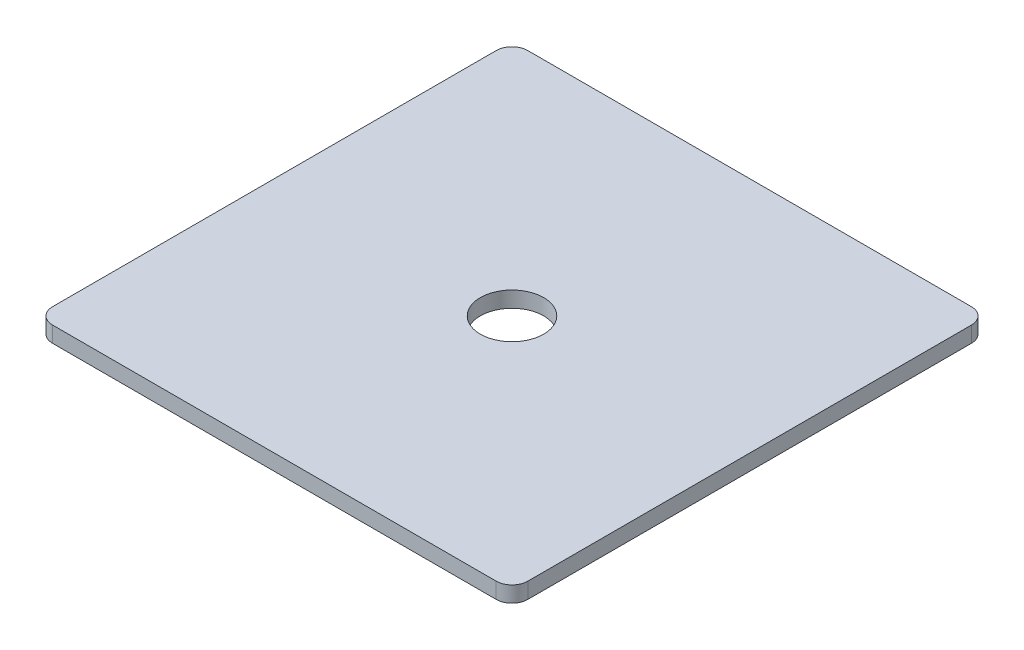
from build123d import *

# Parameters (mm, degrees)
SKIZZE1_R                       = 8
AUFSATZ_LINEAR_AUSTRAGEN1_DEPTH = 4


with BuildPart() as part:
    # Skizze1 → Aufsatz-Linear austragen1 (new body)
    with BuildSketch(Plane(origin=(0, 0, 0), x_dir=(1, 0, 0), z_dir=(0, 1, 0))):
        with BuildLine():
            Line((-56, 60), (56, 60))
            ThreePointArc((56, 60), (58.828427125, 58.828427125), (60, 56))
            Line((60, 56), (60, -56))
            ThreePointArc((60, -56), (58.828427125, -58.828427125), (56, -60))
            Line((56, -60), (-56, -60))
            ThreePointArc((-56, -60), (-58.828427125, -58.828427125), (-60, -56))
            Line((-60, -56), (-60, 56))
            ThreePointArc((-60, 56), (-58.828427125, 58.828427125), (-56, 60))
        make_face()
        with Locations(Location((0, 0, 0), (0, 0, 270))):
            Circle(SKIZZE1_R, mode=Mode.SUBTRACT)
    extrude(amount=AUFSATZ_LINEAR_AUSTRAGEN1_DEPTH)


solid = part.part
